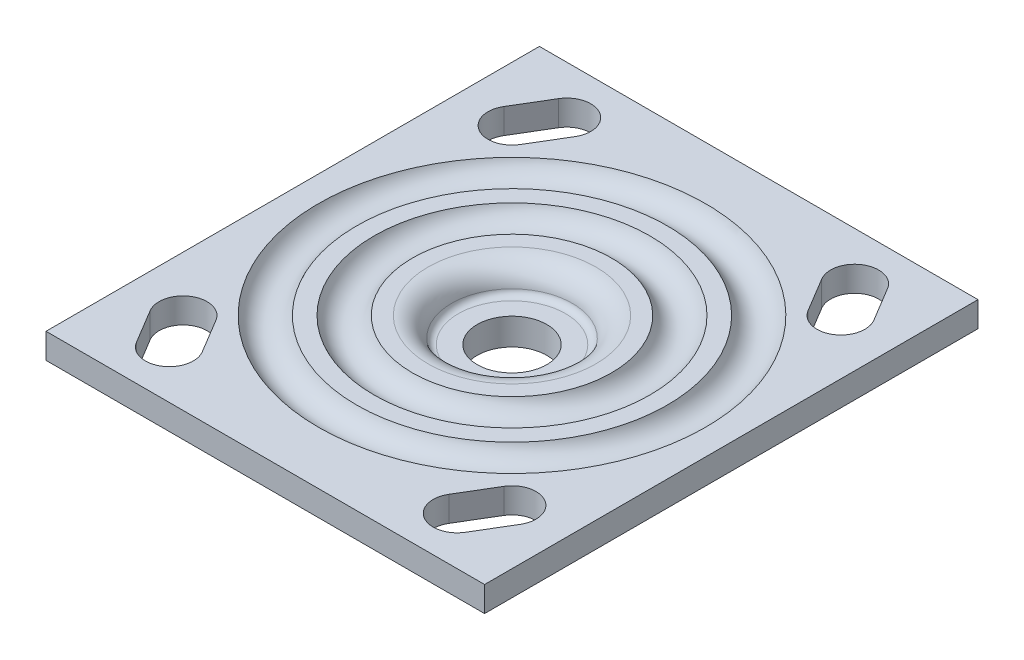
ISO-10303-21;
HEADER;
FILE_DESCRIPTION(('STEP AP214'),'2;1');
FILE_NAME('part.step','',(''),(''),'','','');
FILE_SCHEMA(('AUTOMOTIVE_DESIGN { 1 0 10303 214 1 1 1 1 }'));
ENDSEC;
DATA;
#1=APPLICATION_CONTEXT('core data for automotive mechanical design processes');
#2=APPLICATION_PROTOCOL_DEFINITION('international standard','automotive_design',2000,#1);
#3=PRODUCT_CONTEXT('',#1,'mechanical');
#4=PRODUCT('Part','Part','',(#3));
#5=PRODUCT_RELATED_PRODUCT_CATEGORY('part','',(#4));
#6=PRODUCT_DEFINITION_FORMATION('','',#4);
#7=PRODUCT_DEFINITION_CONTEXT('part definition',#1,'design');
#8=PRODUCT_DEFINITION('design','',#6,#7);
#9=PRODUCT_DEFINITION_SHAPE('','',#8);
#10=(LENGTH_UNIT() NAMED_UNIT(*) SI_UNIT(.MILLI.,.METRE.));
#11=(NAMED_UNIT(*) PLANE_ANGLE_UNIT() SI_UNIT($,.RADIAN.));
#12=(NAMED_UNIT(*) SI_UNIT($,.STERADIAN.) SOLID_ANGLE_UNIT());
#13=UNCERTAINTY_MEASURE_WITH_UNIT(LENGTH_MEASURE(1.E-05),#10,'distance_accuracy_value','');
#14=(GEOMETRIC_REPRESENTATION_CONTEXT(3) GLOBAL_UNCERTAINTY_ASSIGNED_CONTEXT((#13)) GLOBAL_UNIT_ASSIGNED_CONTEXT((#10,
#11,#12)) REPRESENTATION_CONTEXT('',''));
#15=CARTESIAN_POINT('',(0.,0.,0.));
#16=DIRECTION('',(0.,0.,1.));
#17=DIRECTION('',(1.,0.,0.));
#18=AXIS2_PLACEMENT_3D('',#15,#16,#17);
#19=CARTESIAN_POINT('',(44.8570225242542,0.,0.));
#20=DIRECTION('',(0.,-1.,0.));
#21=DIRECTION('',(0.,0.,-1.));
#22=AXIS2_PLACEMENT_3D('',#19,#20,#21);
#23=PLANE('',#22);
#24=DIRECTION('',(-0.514495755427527,0.,0.857492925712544));
#25=VECTOR('',#24,1.);
#26=CARTESIAN_POINT('',(33.3355549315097,0.,35.2413329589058));
#27=LINE('',#26,#25);
#28=CARTESIAN_POINT('',(33.3355549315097,0.,35.2413329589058));
#29=VERTEX_POINT('',#28);
#30=CARTESIAN_POINT('',(28.5730549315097,0.,43.1788329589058));
#31=VERTEX_POINT('',#30);
#32=EDGE_CURVE('E525',#29,#31,#27,.T.);
#33=ORIENTED_EDGE('',*,*,#32,.F.);
#34=CARTESIAN_POINT('',(38.1,0.,38.1));
#35=DIRECTION('',(0.,1.,0.));
#36=DIRECTION('',(0.,0.,1.));
#37=AXIS2_PLACEMENT_3D('',#34,#35,#36);
#38=CIRCLE('',#37,5.55625);
#39=CARTESIAN_POINT('',(42.8644450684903,0.,40.9586670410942));
#40=VERTEX_POINT('',#39);
#41=EDGE_CURVE('E381',#40,#29,#38,.T.);
#42=ORIENTED_EDGE('',*,*,#41,.F.);
#43=DIRECTION('',(0.514495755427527,0.,-0.857492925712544));
#44=VECTOR('',#43,1.);
#45=CARTESIAN_POINT('',(42.8644450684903,0.,40.9586670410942));
#46=LINE('',#45,#44);
#47=CARTESIAN_POINT('',(38.1019450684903,0.,48.8961670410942));
#48=VERTEX_POINT('',#47);
#49=EDGE_CURVE('E511',#48,#40,#46,.T.);
#50=ORIENTED_EDGE('',*,*,#49,.F.);
#51=CARTESIAN_POINT('',(33.3375,0.,46.0375));
#52=DIRECTION('',(0.,1.,0.));
#53=DIRECTION('',(0.,0.,1.));
#54=AXIS2_PLACEMENT_3D('',#51,#52,#53);
#55=CIRCLE('',#54,5.55625);
#56=EDGE_CURVE('E531',#31,#48,#55,.T.);
#57=ORIENTED_EDGE('',*,*,#56,.F.);
#58=EDGE_LOOP('',(#33,#42,#50,#57));
#59=FACE_BOUND('',#58,.T.);
#60=DIRECTION('',(0.514495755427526,0.,0.857492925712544));
#61=VECTOR('',#60,1.);
#62=CARTESIAN_POINT('',(33.3355549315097,0.,-35.2413329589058));
#63=LINE('',#62,#61);
#64=CARTESIAN_POINT('',(28.5730549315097,0.,-43.1788329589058));
#65=VERTEX_POINT('',#64);
#66=CARTESIAN_POINT('',(33.3355549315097,0.,-35.2413329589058));
#67=VERTEX_POINT('',#66);
#68=EDGE_CURVE('E549',#65,#67,#63,.T.);
#69=ORIENTED_EDGE('',*,*,#68,.F.);
#70=CARTESIAN_POINT('',(33.3375,0.,-46.0375));
#71=DIRECTION('',(0.,1.,0.));
#72=DIRECTION('',(0.,0.,1.));
#73=AXIS2_PLACEMENT_3D('',#70,#71,#72);
#74=CIRCLE('',#73,5.55625);
#75=CARTESIAN_POINT('',(38.1019450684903,0.,-48.8961670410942));
#76=VERTEX_POINT('',#75);
#77=EDGE_CURVE('E547',#76,#65,#74,.T.);
#78=ORIENTED_EDGE('',*,*,#77,.F.);
#79=DIRECTION('',(-0.514495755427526,0.,-0.857492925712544));
#80=VECTOR('',#79,1.);
#81=CARTESIAN_POINT('',(38.1019450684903,0.,-48.8961670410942));
#82=LINE('',#81,#80);
#83=CARTESIAN_POINT('',(42.8644450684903,0.,-40.9586670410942));
#84=VERTEX_POINT('',#83);
#85=EDGE_CURVE('E555',#84,#76,#82,.T.);
#86=ORIENTED_EDGE('',*,*,#85,.F.);
#87=CARTESIAN_POINT('',(38.1,0.,-38.1));
#88=DIRECTION('',(0.,1.,0.));
#89=DIRECTION('',(0.,0.,1.));
#90=AXIS2_PLACEMENT_3D('',#87,#88,#89);
#91=CIRCLE('',#90,5.55625);
#92=EDGE_CURVE('E552',#67,#84,#91,.T.);
#93=ORIENTED_EDGE('',*,*,#92,.F.);
#94=EDGE_LOOP('',(#69,#78,#86,#93));
#95=FACE_BOUND('',#94,.T.);
#96=DIRECTION('',(0.514495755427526,0.,-0.857492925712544));
#97=VECTOR('',#96,1.);
#98=CARTESIAN_POINT('',(-33.3355549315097,0.,-35.2413329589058));
#99=LINE('',#98,#97);
#100=CARTESIAN_POINT('',(-33.3355549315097,0.,-35.2413329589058));
#101=VERTEX_POINT('',#100);
#102=CARTESIAN_POINT('',(-28.5730549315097,0.,-43.1788329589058));
#103=VERTEX_POINT('',#102);
#104=EDGE_CURVE('E580',#101,#103,#99,.T.);
#105=ORIENTED_EDGE('',*,*,#104,.F.);
#106=CARTESIAN_POINT('',(-38.1,0.,-38.1));
#107=DIRECTION('',(0.,1.,0.));
#108=DIRECTION('',(0.,0.,1.));
#109=AXIS2_PLACEMENT_3D('',#106,#107,#108);
#110=CIRCLE('',#109,5.55625);
#111=CARTESIAN_POINT('',(-42.8644450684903,0.,-40.9586670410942));
#112=VERTEX_POINT('',#111);
#113=EDGE_CURVE('E578',#112,#101,#110,.T.);
#114=ORIENTED_EDGE('',*,*,#113,.F.);
#115=DIRECTION('',(-0.514495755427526,0.,0.857492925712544));
#116=VECTOR('',#115,1.);
#117=CARTESIAN_POINT('',(-38.1019450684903,0.,-48.8961670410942));
#118=LINE('',#117,#116);
#119=CARTESIAN_POINT('',(-38.1019450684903,0.,-48.8961670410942));
#120=VERTEX_POINT('',#119);
#121=EDGE_CURVE('E586',#120,#112,#118,.T.);
#122=ORIENTED_EDGE('',*,*,#121,.F.);
#123=CARTESIAN_POINT('',(-33.3375,0.,-46.0375));
#124=DIRECTION('',(0.,1.,0.));
#125=DIRECTION('',(0.,0.,1.));
#126=AXIS2_PLACEMENT_3D('',#123,#124,#125);
#127=CIRCLE('',#126,5.55625);
#128=EDGE_CURVE('E583',#103,#120,#127,.T.);
#129=ORIENTED_EDGE('',*,*,#128,.F.);
#130=EDGE_LOOP('',(#105,#114,#122,#129));
#131=FACE_BOUND('',#130,.T.);
#132=DIRECTION('',(0.514495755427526,0.,0.857492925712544));
#133=VECTOR('',#132,1.);
#134=CARTESIAN_POINT('',(-42.8644450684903,0.,40.9586670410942));
#135=LINE('',#134,#133);
#136=CARTESIAN_POINT('',(-42.8644450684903,0.,40.9586670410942));
#137=VERTEX_POINT('',#136);
#138=CARTESIAN_POINT('',(-38.1019450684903,0.,48.8961670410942));
#139=VERTEX_POINT('',#138);
#140=EDGE_CURVE('E611',#137,#139,#135,.T.);
#141=ORIENTED_EDGE('',*,*,#140,.F.);
#142=CARTESIAN_POINT('',(-38.1,0.,38.1));
#143=DIRECTION('',(0.,1.,0.));
#144=DIRECTION('',(0.,0.,1.));
#145=AXIS2_PLACEMENT_3D('',#142,#143,#144);
#146=CIRCLE('',#145,5.55625);
#147=CARTESIAN_POINT('',(-33.3355549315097,0.,35.2413329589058));
#148=VERTEX_POINT('',#147);
#149=EDGE_CURVE('E609',#148,#137,#146,.T.);
#150=ORIENTED_EDGE('',*,*,#149,.F.);
#151=DIRECTION('',(-0.514495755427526,0.,-0.857492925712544));
#152=VECTOR('',#151,1.);
#153=CARTESIAN_POINT('',(-28.5730549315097,0.,43.1788329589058));
#154=LINE('',#153,#152);
#155=CARTESIAN_POINT('',(-28.5730549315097,0.,43.1788329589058));
#156=VERTEX_POINT('',#155);
#157=EDGE_CURVE('E617',#156,#148,#154,.T.);
#158=ORIENTED_EDGE('',*,*,#157,.F.);
#159=CARTESIAN_POINT('',(-33.3375,0.,46.0375));
#160=DIRECTION('',(0.,1.,0.));
#161=DIRECTION('',(0.,0.,1.));
#162=AXIS2_PLACEMENT_3D('',#159,#160,#161);
#163=CIRCLE('',#162,5.55625);
#164=EDGE_CURVE('E614',#139,#156,#163,.T.);
#165=ORIENTED_EDGE('',*,*,#164,.F.);
#166=EDGE_LOOP('',(#141,#150,#158,#165));
#167=FACE_BOUND('',#166,.T.);
#168=CARTESIAN_POINT('',(0.,0.,0.));
#169=DIRECTION('',(0.,1.,0.));
#170=DIRECTION('',(0.,0.,1.));
#171=AXIS2_PLACEMENT_3D('',#168,#169,#170);
#172=CIRCLE('',#171,44.8570225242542);
#173=CARTESIAN_POINT('',(0.,0.,44.8570225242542));
#174=VERTEX_POINT('',#173);
#175=EDGE_CURVE('E11',#174,#174,#172,.T.);
#176=ORIENTED_EDGE('',*,*,#175,.F.);
#177=EDGE_LOOP('',(#176));
#178=FACE_BOUND('',#177,.T.);
#179=DIRECTION('',(0.,0.,1.));
#180=VECTOR('',#179,1.);
#181=CARTESIAN_POINT('',(-50.8,0.,-57.15));
#182=LINE('',#181,#180);
#183=CARTESIAN_POINT('',(-50.8,0.,-57.15));
#184=VERTEX_POINT('',#183);
#185=CARTESIAN_POINT('',(-50.8,0.,57.15));
#186=VERTEX_POINT('',#185);
#187=EDGE_CURVE('E632',#184,#186,#182,.T.);
#188=ORIENTED_EDGE('',*,*,#187,.T.);
#189=DIRECTION('',(1.,0.,0.));
#190=VECTOR('',#189,1.);
#191=CARTESIAN_POINT('',(-50.8,0.,57.15));
#192=LINE('',#191,#190);
#193=CARTESIAN_POINT('',(50.8,0.,57.15));
#194=VERTEX_POINT('',#193);
#195=EDGE_CURVE('E645',#186,#194,#192,.T.);
#196=ORIENTED_EDGE('',*,*,#195,.T.);
#197=DIRECTION('',(0.,0.,-1.));
#198=VECTOR('',#197,1.);
#199=CARTESIAN_POINT('',(50.8,0.,-57.15));
#200=LINE('',#199,#198);
#201=CARTESIAN_POINT('',(50.8,0.,-57.15));
#202=VERTEX_POINT('',#201);
#203=EDGE_CURVE('E648',#194,#202,#200,.T.);
#204=ORIENTED_EDGE('',*,*,#203,.T.);
#205=DIRECTION('',(-1.,0.,0.));
#206=VECTOR('',#205,1.);
#207=CARTESIAN_POINT('',(-50.8,0.,-57.15));
#208=LINE('',#207,#206);
#209=EDGE_CURVE('E651',#202,#184,#208,.T.);
#210=ORIENTED_EDGE('',*,*,#209,.T.);
#211=EDGE_LOOP('',(#188,#196,#204,#210));
#212=FACE_BOUND('',#211,.T.);
#213=ADVANCED_FACE('F367',(#59,#95,#131,#167,#178,#212),#23,.F.);
#214=CARTESIAN_POINT('',(0.,1.7526,0.));
#215=DIRECTION('',(0.,1.,0.));
#216=DIRECTION('',(0.,0.,1.));
#217=AXIS2_PLACEMENT_3D('',#214,#215,#216);
#218=TOROIDAL_SURFACE('',#217,40.41507157,4.7752);
#219=CARTESIAN_POINT('',(0.,0.,0.));
#220=DIRECTION('',(0.,1.,0.));
#221=DIRECTION('',(0.,0.,1.));
#222=AXIS2_PLACEMENT_3D('',#219,#220,#221);
#223=CIRCLE('',#222,35.9731206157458);
#224=CARTESIAN_POINT('',(0.,0.,35.9731206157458));
#225=VERTEX_POINT('',#224);
#226=EDGE_CURVE('E374',#225,#225,#223,.T.);
#227=ORIENTED_EDGE('',*,*,#226,.F.);
#228=EDGE_LOOP('',(#227));
#229=FACE_BOUND('',#228,.T.);
#230=ORIENTED_EDGE('',*,*,#175,.T.);
#231=EDGE_LOOP('',(#230));
#232=FACE_BOUND('',#231,.T.);
#233=ADVANCED_FACE('F709',(#229,#232),#218,.F.);
#234=CARTESIAN_POINT('',(31.9406259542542,0.,0.));
#235=DIRECTION('',(0.,-1.,0.));
#236=DIRECTION('',(0.,0.,-1.));
#237=AXIS2_PLACEMENT_3D('',#234,#235,#236);
#238=PLANE('',#237);
#239=CARTESIAN_POINT('',(0.,0.,0.));
#240=DIRECTION('',(0.,1.,0.));
#241=DIRECTION('',(0.,0.,1.));
#242=AXIS2_PLACEMENT_3D('',#239,#240,#241);
#243=CIRCLE('',#242,31.9406259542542);
#244=CARTESIAN_POINT('',(0.,0.,31.9406259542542));
#245=VERTEX_POINT('',#244);
#246=EDGE_CURVE('E702',#245,#245,#243,.T.);
#247=ORIENTED_EDGE('',*,*,#246,.F.);
#248=EDGE_LOOP('',(#247));
#249=FACE_BOUND('',#248,.T.);
#250=ORIENTED_EDGE('',*,*,#226,.T.);
#251=EDGE_LOOP('',(#250));
#252=FACE_BOUND('',#251,.T.);
#253=ADVANCED_FACE('F707',(#249,#252),#238,.F.);
#254=CARTESIAN_POINT('',(0.,1.7526,0.));
#255=DIRECTION('',(0.,1.,0.));
#256=DIRECTION('',(0.,0.,1.));
#257=AXIS2_PLACEMENT_3D('',#254,#255,#256);
#258=TOROIDAL_SURFACE('',#257,27.498675,4.7752);
#259=CARTESIAN_POINT('',(0.,0.,0.));
#260=DIRECTION('',(0.,1.,0.));
#261=DIRECTION('',(0.,0.,1.));
#262=AXIS2_PLACEMENT_3D('',#259,#260,#261);
#263=CIRCLE('',#262,23.0567240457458);
#264=CARTESIAN_POINT('',(0.,0.,23.0567240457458));
#265=VERTEX_POINT('',#264);
#266=EDGE_CURVE('E699',#265,#265,#263,.T.);
#267=ORIENTED_EDGE('',*,*,#266,.F.);
#268=EDGE_LOOP('',(#267));
#269=FACE_BOUND('',#268,.T.);
#270=ORIENTED_EDGE('',*,*,#246,.T.);
#271=EDGE_LOOP('',(#270));
#272=FACE_BOUND('',#271,.T.);
#273=ADVANCED_FACE('F798',(#269,#272),#258,.F.);
#274=CARTESIAN_POINT('',(19.441696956,0.,0.));
#275=DIRECTION('',(0.,-1.,0.));
#276=DIRECTION('',(0.,0.,-1.));
#277=AXIS2_PLACEMENT_3D('',#274,#275,#276);
#278=PLANE('',#277);
#279=CARTESIAN_POINT('',(0.,0.,0.));
#280=DIRECTION('',(0.,1.,0.));
#281=DIRECTION('',(0.,0.,1.));
#282=AXIS2_PLACEMENT_3D('',#279,#280,#281);
#283=CIRCLE('',#282,19.441696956);
#284=CARTESIAN_POINT('',(0.,0.,19.441696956));
#285=VERTEX_POINT('',#284);
#286=EDGE_CURVE('E696',#285,#285,#283,.T.);
#287=ORIENTED_EDGE('',*,*,#286,.F.);
#288=EDGE_LOOP('',(#287));
#289=FACE_BOUND('',#288,.T.);
#290=ORIENTED_EDGE('',*,*,#266,.T.);
#291=EDGE_LOOP('',(#290));
#292=FACE_BOUND('',#291,.T.);
#293=ADVANCED_FACE('F794',(#289,#292),#278,.F.);
#294=CARTESIAN_POINT('',(0.,-5.55625,0.));
#295=DIRECTION('',(0.,1.,0.));
#296=DIRECTION('',(0.,0.,1.));
#297=AXIS2_PLACEMENT_3D('',#294,#295,#296);
#298=TOROIDAL_SURFACE('',#297,19.441696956,5.55625);
#299=CARTESIAN_POINT('',(0.,-4.54377777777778,0.));
#300=DIRECTION('',(0.,1.,0.));
#301=DIRECTION('',(0.,0.,1.));
#302=AXIS2_PLACEMENT_3D('',#299,#300,#301);
#303=CIRCLE('',#302,13.9784731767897);
#304=CARTESIAN_POINT('',(0.,-4.54377777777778,13.9784731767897));
#305=VERTEX_POINT('',#304);
#306=EDGE_CURVE('E693',#305,#305,#303,.T.);
#307=ORIENTED_EDGE('',*,*,#306,.F.);
#308=EDGE_LOOP('',(#307));
#309=FACE_BOUND('',#308,.T.);
#310=ORIENTED_EDGE('',*,*,#286,.T.);
#311=EDGE_LOOP('',(#310));
#312=FACE_BOUND('',#311,.T.);
#313=ADVANCED_FACE('F790',(#309,#312),#298,.T.);
#314=CARTESIAN_POINT('',(0.,-4.2545,0.));
#315=DIRECTION('',(0.,1.,0.));
#316=DIRECTION('',(0.,0.,1.));
#317=AXIS2_PLACEMENT_3D('',#314,#315,#316);
#318=TOROIDAL_SURFACE('',#317,12.4175520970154,1.5875);
#319=CARTESIAN_POINT('',(0.,-5.842,0.));
#320=DIRECTION('',(0.,1.,0.));
#321=DIRECTION('',(0.,0.,1.));
#322=AXIS2_PLACEMENT_3D('',#319,#320,#321);
#323=CIRCLE('',#322,12.4175520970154);
#324=CARTESIAN_POINT('',(0.,-5.842,12.4175520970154));
#325=VERTEX_POINT('',#324);
#326=EDGE_CURVE('E690',#325,#325,#323,.T.);
#327=ORIENTED_EDGE('',*,*,#326,.F.);
#328=EDGE_LOOP('',(#327));
#329=FACE_BOUND('',#328,.T.);
#330=ORIENTED_EDGE('',*,*,#306,.T.);
#331=EDGE_LOOP('',(#330));
#332=FACE_BOUND('',#331,.T.);
#333=ADVANCED_FACE('F786',(#329,#332),#318,.F.);
#334=CARTESIAN_POINT('',(8.0645,-5.842,0.));
#335=DIRECTION('',(0.,-1.,0.));
#336=DIRECTION('',(0.,0.,-1.));
#337=AXIS2_PLACEMENT_3D('',#334,#335,#336);
#338=PLANE('',#337);
#339=CARTESIAN_POINT('',(0.,-5.842,0.));
#340=DIRECTION('',(0.,1.,0.));
#341=DIRECTION('',(0.,0.,1.));
#342=AXIS2_PLACEMENT_3D('',#339,#340,#341);
#343=CIRCLE('',#342,8.0645);
#344=CARTESIAN_POINT('',(0.,-5.842,8.0645));
#345=VERTEX_POINT('',#344);
#346=EDGE_CURVE('E687',#345,#345,#343,.T.);
#347=ORIENTED_EDGE('',*,*,#346,.F.);
#348=EDGE_LOOP('',(#347));
#349=FACE_BOUND('',#348,.T.);
#350=ORIENTED_EDGE('',*,*,#326,.T.);
#351=EDGE_LOOP('',(#350));
#352=FACE_BOUND('',#351,.T.);
#353=ADVANCED_FACE('F782',(#349,#352),#338,.F.);
#354=CARTESIAN_POINT('',(0.,0.,0.));
#355=DIRECTION('',(0.,1.,0.));
#356=DIRECTION('',(0.,0.,1.));
#357=AXIS2_PLACEMENT_3D('',#354,#355,#356);
#358=CYLINDRICAL_SURFACE('',#357,8.0645);
#359=CARTESIAN_POINT('',(0.,-12.0396,0.));
#360=DIRECTION('',(0.,1.,0.));
#361=DIRECTION('',(0.,0.,1.));
#362=AXIS2_PLACEMENT_3D('',#359,#360,#361);
#363=CIRCLE('',#362,8.0645);
#364=CARTESIAN_POINT('',(0.,-12.0396,8.0645));
#365=VERTEX_POINT('',#364);
#366=EDGE_CURVE('E684',#365,#365,#363,.T.);
#367=ORIENTED_EDGE('',*,*,#366,.F.);
#368=EDGE_LOOP('',(#367));
#369=FACE_BOUND('',#368,.T.);
#370=ORIENTED_EDGE('',*,*,#346,.T.);
#371=EDGE_LOOP('',(#370));
#372=FACE_BOUND('',#371,.T.);
#373=ADVANCED_FACE('F778',(#369,#372),#358,.F.);
#374=CARTESIAN_POINT('',(14.0562775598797,-12.0396,0.));
#375=DIRECTION('',(0.,1.,0.));
#376=DIRECTION('',(0.,0.,1.));
#377=AXIS2_PLACEMENT_3D('',#374,#375,#376);
#378=PLANE('',#377);
#379=CARTESIAN_POINT('',(0.,-12.0396,0.));
#380=DIRECTION('',(0.,1.,0.));
#381=DIRECTION('',(0.,0.,1.));
#382=AXIS2_PLACEMENT_3D('',#379,#380,#381);
#383=CIRCLE('',#382,14.0562775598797);
#384=CARTESIAN_POINT('',(0.,-12.0396,14.0562775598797));
#385=VERTEX_POINT('',#384);
#386=EDGE_CURVE('E681',#385,#385,#383,.T.);
#387=ORIENTED_EDGE('',*,*,#386,.F.);
#388=EDGE_LOOP('',(#387));
#389=FACE_BOUND('',#388,.T.);
#390=ORIENTED_EDGE('',*,*,#366,.T.);
#391=EDGE_LOOP('',(#390));
#392=FACE_BOUND('',#391,.T.);
#393=ADVANCED_FACE('F774',(#389,#392),#378,.F.);
#394=CARTESIAN_POINT('',(0.,-6.5024,0.));
#395=DIRECTION('',(0.,1.,0.));
#396=DIRECTION('',(0.,0.,1.));
#397=AXIS2_PLACEMENT_3D('',#394,#395,#396);
#398=TOROIDAL_SURFACE('',#397,14.0562775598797,5.5372);
#399=CARTESIAN_POINT('',(0.,-8.4295083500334,0.));
#400=DIRECTION('',(0.,1.,0.));
#401=DIRECTION('',(0.,0.,1.));
#402=AXIS2_PLACEMENT_3D('',#399,#400,#401);
#403=CIRCLE('',#402,19.2473118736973);
#404=CARTESIAN_POINT('',(0.,-8.4295083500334,19.2473118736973));
#405=VERTEX_POINT('',#404);
#406=EDGE_CURVE('E678',#405,#405,#403,.T.);
#407=ORIENTED_EDGE('',*,*,#406,.F.);
#408=EDGE_LOOP('',(#407));
#409=FACE_BOUND('',#408,.T.);
#410=ORIENTED_EDGE('',*,*,#386,.T.);
#411=EDGE_LOOP('',(#410));
#412=FACE_BOUND('',#411,.T.);
#413=ADVANCED_FACE('F770',(#409,#412),#398,.T.);
#414=CARTESIAN_POINT('',(0.,-9.81075,0.));
#415=DIRECTION('',(0.,1.,0.));
#416=DIRECTION('',(0.,0.,1.));
#417=AXIS2_PLACEMENT_3D('',#414,#415,#416);
#418=TOROIDAL_SURFACE('',#417,22.96795,3.96875);
#419=CARTESIAN_POINT('',(0.,-7.239,0.));
#420=DIRECTION('',(0.,1.,0.));
#421=DIRECTION('',(0.,0.,1.));
#422=AXIS2_PLACEMENT_3D('',#419,#420,#421);
#423=CIRCLE('',#422,25.9907100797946);
#424=CARTESIAN_POINT('',(0.,-7.239,25.9907100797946));
#425=VERTEX_POINT('',#424);
#426=EDGE_CURVE('E675',#425,#425,#423,.T.);
#427=ORIENTED_EDGE('',*,*,#426,.F.);
#428=EDGE_LOOP('',(#427));
#429=FACE_BOUND('',#428,.T.);
#430=ORIENTED_EDGE('',*,*,#406,.T.);
#431=EDGE_LOOP('',(#430));
#432=FACE_BOUND('',#431,.T.);
#433=ADVANCED_FACE('F766',(#429,#432),#418,.F.);
#434=CARTESIAN_POINT('',(30.0768481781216,-7.239,0.));
#435=DIRECTION('',(0.,1.,0.));
#436=DIRECTION('',(0.,0.,1.));
#437=AXIS2_PLACEMENT_3D('',#434,#435,#436);
#438=PLANE('',#437);
#439=CARTESIAN_POINT('',(0.,-7.239,0.));
#440=DIRECTION('',(0.,1.,0.));
#441=DIRECTION('',(0.,0.,1.));
#442=AXIS2_PLACEMENT_3D('',#439,#440,#441);
#443=CIRCLE('',#442,30.0768481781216);
#444=CARTESIAN_POINT('',(0.,-7.239,30.0768481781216));
#445=VERTEX_POINT('',#444);
#446=EDGE_CURVE('E672',#445,#445,#443,.T.);
#447=ORIENTED_EDGE('',*,*,#446,.F.);
#448=EDGE_LOOP('',(#447));
#449=FACE_BOUND('',#448,.T.);
#450=ORIENTED_EDGE('',*,*,#426,.T.);
#451=EDGE_LOOP('',(#450));
#452=FACE_BOUND('',#451,.T.);
#453=ADVANCED_FACE('F762',(#449,#452),#438,.F.);
#454=CARTESIAN_POINT('',(0.,-10.6172,0.));
#455=DIRECTION('',(0.,1.,0.));
#456=DIRECTION('',(0.,0.,1.));
#457=AXIS2_PLACEMENT_3D('',#454,#455,#456);
#458=TOROIDAL_SURFACE('',#457,33.4518,4.7752);
#459=CARTESIAN_POINT('',(0.,-7.239,0.));
#460=DIRECTION('',(0.,1.,0.));
#461=DIRECTION('',(0.,0.,1.));
#462=AXIS2_PLACEMENT_3D('',#459,#460,#461);
#463=CIRCLE('',#462,36.8267518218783);
#464=CARTESIAN_POINT('',(0.,-7.239,36.8267518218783));
#465=VERTEX_POINT('',#464);
#466=EDGE_CURVE('E669',#465,#465,#463,.T.);
#467=ORIENTED_EDGE('',*,*,#466,.F.);
#468=EDGE_LOOP('',(#467));
#469=FACE_BOUND('',#468,.T.);
#470=ORIENTED_EDGE('',*,*,#446,.T.);
#471=EDGE_LOOP('',(#470));
#472=FACE_BOUND('',#471,.T.);
#473=ADVANCED_FACE('F758',(#469,#472),#458,.F.);
#474=CARTESIAN_POINT('',(42.6670247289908,-7.239,0.));
#475=DIRECTION('',(0.,1.,0.));
#476=DIRECTION('',(0.,0.,1.));
#477=AXIS2_PLACEMENT_3D('',#474,#475,#476);
#478=PLANE('',#477);
#479=CARTESIAN_POINT('',(0.,-7.239,0.));
#480=DIRECTION('',(0.,1.,0.));
#481=DIRECTION('',(0.,0.,1.));
#482=AXIS2_PLACEMENT_3D('',#479,#480,#481);
#483=CIRCLE('',#482,42.6670247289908);
#484=CARTESIAN_POINT('',(0.,-7.239,42.6670247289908));
#485=VERTEX_POINT('',#484);
#486=EDGE_CURVE('E666',#485,#485,#483,.T.);
#487=ORIENTED_EDGE('',*,*,#486,.F.);
#488=EDGE_LOOP('',(#487));
#489=FACE_BOUND('',#488,.T.);
#490=ORIENTED_EDGE('',*,*,#466,.T.);
#491=EDGE_LOOP('',(#490));
#492=FACE_BOUND('',#491,.T.);
#493=ADVANCED_FACE('F754',(#489,#492),#478,.F.);
#494=CARTESIAN_POINT('',(0.,-6.127115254,0.));
#495=DIRECTION('',(0.,1.,0.));
#496=DIRECTION('',(0.,0.,1.));
#497=AXIS2_PLACEMENT_3D('',#494,#495,#496);
#498=TOROIDAL_SURFACE('',#497,42.6670247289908,1.111884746);
#499=CARTESIAN_POINT('',(0.,-6.5405,0.));
#500=DIRECTION('',(0.,1.,0.));
#501=DIRECTION('',(0.,0.,1.));
#502=AXIS2_PLACEMENT_3D('',#499,#500,#501);
#503=CIRCLE('',#502,43.699207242);
#504=CARTESIAN_POINT('',(0.,-6.5405,43.699207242));
#505=VERTEX_POINT('',#504);
#506=EDGE_CURVE('E663',#505,#505,#503,.T.);
#507=ORIENTED_EDGE('',*,*,#506,.F.);
#508=EDGE_LOOP('',(#507));
#509=FACE_BOUND('',#508,.T.);
#510=ORIENTED_EDGE('',*,*,#486,.T.);
#511=EDGE_LOOP('',(#510));
#512=FACE_BOUND('',#511,.T.);
#513=ADVANCED_FACE('F747',(#509,#512),#498,.T.);
#514=CARTESIAN_POINT('',(0.,-6.953884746,0.));
#515=DIRECTION('',(0.,1.,0.));
#516=DIRECTION('',(0.,0.,1.));
#517=AXIS2_PLACEMENT_3D('',#514,#515,#516);
#518=TOROIDAL_SURFACE('',#517,44.7313897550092,1.111884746);
#519=CARTESIAN_POINT('',(0.,-5.842,0.));
#520=DIRECTION('',(0.,1.,0.));
#521=DIRECTION('',(0.,0.,1.));
#522=AXIS2_PLACEMENT_3D('',#519,#520,#521);
#523=CIRCLE('',#522,44.7313897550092);
#524=CARTESIAN_POINT('',(0.,-5.842,44.7313897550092));
#525=VERTEX_POINT('',#524);
#526=EDGE_CURVE('E635',#525,#525,#523,.T.);
#527=ORIENTED_EDGE('',*,*,#526,.F.);
#528=EDGE_LOOP('',(#527));
#529=FACE_BOUND('',#528,.T.);
#530=ORIENTED_EDGE('',*,*,#506,.T.);
#531=EDGE_LOOP('',(#530));
#532=FACE_BOUND('',#531,.T.);
#533=ADVANCED_FACE('F739',(#529,#532),#518,.F.);
#534=CARTESIAN_POINT('',(47.625,-5.842,0.));
#535=DIRECTION('',(0.,1.,0.));
#536=DIRECTION('',(0.,0.,1.));
#537=AXIS2_PLACEMENT_3D('',#534,#535,#536);
#538=PLANE('',#537);
#539=DIRECTION('',(-0.514495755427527,0.,0.857492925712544));
#540=VECTOR('',#539,1.);
#541=CARTESIAN_POINT('',(42.8644450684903,-5.842,40.9586670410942));
#542=LINE('',#541,#540);
#543=CARTESIAN_POINT('',(42.8644450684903,-5.842,40.9586670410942));
#544=VERTEX_POINT('',#543);
#545=CARTESIAN_POINT('',(38.1019450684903,-5.842,48.8961670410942));
#546=VERTEX_POINT('',#545);
#547=EDGE_CURVE('E523',#544,#546,#542,.T.);
#548=ORIENTED_EDGE('',*,*,#547,.F.);
#549=CARTESIAN_POINT('',(38.1,-5.842,38.1));
#550=DIRECTION('',(0.,1.,0.));
#551=DIRECTION('',(0.,0.,1.));
#552=AXIS2_PLACEMENT_3D('',#549,#550,#551);
#553=CIRCLE('',#552,5.55625);
#554=CARTESIAN_POINT('',(33.3355549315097,-5.842,35.2413329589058));
#555=VERTEX_POINT('',#554);
#556=EDGE_CURVE('E505',#555,#544,#553,.F.);
#557=ORIENTED_EDGE('',*,*,#556,.F.);
#558=DIRECTION('',(0.514495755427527,0.,-0.857492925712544));
#559=VECTOR('',#558,1.);
#560=CARTESIAN_POINT('',(33.3355549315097,-5.842,35.2413329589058));
#561=LINE('',#560,#559);
#562=CARTESIAN_POINT('',(28.5730549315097,-5.842,43.1788329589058));
#563=VERTEX_POINT('',#562);
#564=EDGE_CURVE('E514',#563,#555,#561,.T.);
#565=ORIENTED_EDGE('',*,*,#564,.F.);
#566=CARTESIAN_POINT('',(33.3375,-5.842,46.0375));
#567=DIRECTION('',(0.,1.,0.));
#568=DIRECTION('',(0.,0.,1.));
#569=AXIS2_PLACEMENT_3D('',#566,#567,#568);
#570=CIRCLE('',#569,5.55625);
#571=EDGE_CURVE('E389',#546,#563,#570,.F.);
#572=ORIENTED_EDGE('',*,*,#571,.F.);
#573=EDGE_LOOP('',(#548,#557,#565,#572));
#574=FACE_BOUND('',#573,.T.);
#575=DIRECTION('',(0.514495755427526,0.,0.857492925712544));
#576=VECTOR('',#575,1.);
#577=CARTESIAN_POINT('',(38.1019450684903,-5.842,-48.8961670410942));
#578=LINE('',#577,#576);
#579=CARTESIAN_POINT('',(38.1019450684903,-5.842,-48.8961670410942));
#580=VERTEX_POINT('',#579);
#581=CARTESIAN_POINT('',(42.8644450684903,-5.842,-40.9586670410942));
#582=VERTEX_POINT('',#581);
#583=EDGE_CURVE('E541',#580,#582,#578,.T.);
#584=ORIENTED_EDGE('',*,*,#583,.F.);
#585=CARTESIAN_POINT('',(33.3375,-5.842,-46.0375));
#586=DIRECTION('',(0.,1.,0.));
#587=DIRECTION('',(0.,0.,1.));
#588=AXIS2_PLACEMENT_3D('',#585,#586,#587);
#589=CIRCLE('',#588,5.55625);
#590=CARTESIAN_POINT('',(28.5730549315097,-5.842,-43.1788329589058));
#591=VERTEX_POINT('',#590);
#592=EDGE_CURVE('E544',#591,#580,#589,.F.);
#593=ORIENTED_EDGE('',*,*,#592,.F.);
#594=DIRECTION('',(-0.514495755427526,0.,-0.857492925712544));
#595=VECTOR('',#594,1.);
#596=CARTESIAN_POINT('',(33.3355549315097,-5.842,-35.2413329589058));
#597=LINE('',#596,#595);
#598=CARTESIAN_POINT('',(33.3355549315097,-5.842,-35.2413329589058));
#599=VERTEX_POINT('',#598);
#600=EDGE_CURVE('E561',#599,#591,#597,.T.);
#601=ORIENTED_EDGE('',*,*,#600,.F.);
#602=CARTESIAN_POINT('',(38.1,-5.842,-38.1));
#603=DIRECTION('',(0.,1.,0.));
#604=DIRECTION('',(0.,0.,1.));
#605=AXIS2_PLACEMENT_3D('',#602,#603,#604);
#606=CIRCLE('',#605,5.55625);
#607=EDGE_CURVE('E517',#582,#599,#606,.F.);
#608=ORIENTED_EDGE('',*,*,#607,.F.);
#609=EDGE_LOOP('',(#584,#593,#601,#608));
#610=FACE_BOUND('',#609,.T.);
#611=DIRECTION('',(0.514495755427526,0.,-0.857492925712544));
#612=VECTOR('',#611,1.);
#613=CARTESIAN_POINT('',(-38.1019450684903,-5.842,-48.8961670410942));
#614=LINE('',#613,#612);
#615=CARTESIAN_POINT('',(-42.8644450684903,-5.842,-40.9586670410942));
#616=VERTEX_POINT('',#615);
#617=CARTESIAN_POINT('',(-38.1019450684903,-5.842,-48.8961670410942));
#618=VERTEX_POINT('',#617);
#619=EDGE_CURVE('E572',#616,#618,#614,.T.);
#620=ORIENTED_EDGE('',*,*,#619,.F.);
#621=CARTESIAN_POINT('',(-38.1,-5.842,-38.1));
#622=DIRECTION('',(0.,1.,0.));
#623=DIRECTION('',(0.,0.,1.));
#624=AXIS2_PLACEMENT_3D('',#621,#622,#623);
#625=CIRCLE('',#624,5.55625);
#626=CARTESIAN_POINT('',(-33.3355549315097,-5.842,-35.2413329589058));
#627=VERTEX_POINT('',#626);
#628=EDGE_CURVE('E575',#627,#616,#625,.F.);
#629=ORIENTED_EDGE('',*,*,#628,.F.);
#630=DIRECTION('',(-0.514495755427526,0.,0.857492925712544));
#631=VECTOR('',#630,1.);
#632=CARTESIAN_POINT('',(-33.3355549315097,-5.842,-35.2413329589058));
#633=LINE('',#632,#631);
#634=CARTESIAN_POINT('',(-28.5730549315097,-5.842,-43.1788329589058));
#635=VERTEX_POINT('',#634);
#636=EDGE_CURVE('E592',#635,#627,#633,.T.);
#637=ORIENTED_EDGE('',*,*,#636,.F.);
#638=CARTESIAN_POINT('',(-33.3375,-5.842,-46.0375));
#639=DIRECTION('',(0.,1.,0.));
#640=DIRECTION('',(0.,0.,1.));
#641=AXIS2_PLACEMENT_3D('',#638,#639,#640);
#642=CIRCLE('',#641,5.55625);
#643=EDGE_CURVE('E570',#618,#635,#642,.F.);
#644=ORIENTED_EDGE('',*,*,#643,.F.);
#645=EDGE_LOOP('',(#620,#629,#637,#644));
#646=FACE_BOUND('',#645,.T.);
#647=DIRECTION('',(0.514495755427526,0.,0.857492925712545));
#648=VECTOR('',#647,1.);
#649=CARTESIAN_POINT('',(-28.5730549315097,-5.842,43.1788329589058));
#650=LINE('',#649,#648);
#651=CARTESIAN_POINT('',(-33.3355549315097,-5.842,35.2413329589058));
#652=VERTEX_POINT('',#651);
#653=CARTESIAN_POINT('',(-28.5730549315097,-5.842,43.1788329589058));
#654=VERTEX_POINT('',#653);
#655=EDGE_CURVE('E603',#652,#654,#650,.T.);
#656=ORIENTED_EDGE('',*,*,#655,.F.);
#657=CARTESIAN_POINT('',(-38.1,-5.842,38.1));
#658=DIRECTION('',(0.,1.,0.));
#659=DIRECTION('',(0.,0.,1.));
#660=AXIS2_PLACEMENT_3D('',#657,#658,#659);
#661=CIRCLE('',#660,5.55625);
#662=CARTESIAN_POINT('',(-42.8644450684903,-5.842,40.9586670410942));
#663=VERTEX_POINT('',#662);
#664=EDGE_CURVE('E606',#663,#652,#661,.F.);
#665=ORIENTED_EDGE('',*,*,#664,.F.);
#666=DIRECTION('',(-0.514495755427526,0.,-0.857492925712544));
#667=VECTOR('',#666,1.);
#668=CARTESIAN_POINT('',(-42.8644450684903,-5.842,40.9586670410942));
#669=LINE('',#668,#667);
#670=CARTESIAN_POINT('',(-38.1019450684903,-5.842,48.8961670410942));
#671=VERTEX_POINT('',#670);
#672=EDGE_CURVE('E623',#671,#663,#669,.T.);
#673=ORIENTED_EDGE('',*,*,#672,.F.);
#674=CARTESIAN_POINT('',(-33.3375,-5.842,46.0375));
#675=DIRECTION('',(0.,1.,0.));
#676=DIRECTION('',(0.,0.,1.));
#677=AXIS2_PLACEMENT_3D('',#674,#675,#676);
#678=CIRCLE('',#677,5.55625);
#679=EDGE_CURVE('E601',#654,#671,#678,.F.);
#680=ORIENTED_EDGE('',*,*,#679,.F.);
#681=EDGE_LOOP('',(#656,#665,#673,#680));
#682=FACE_BOUND('',#681,.T.);
#683=ORIENTED_EDGE('',*,*,#526,.T.);
#684=EDGE_LOOP('',(#683));
#685=FACE_BOUND('',#684,.T.);
#686=DIRECTION('',(0.,0.,-1.));
#687=VECTOR('',#686,1.);
#688=CARTESIAN_POINT('',(-50.8,-5.84200000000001,-57.15));
#689=LINE('',#688,#687);
#690=CARTESIAN_POINT('',(-50.8,-5.84200000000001,57.15));
#691=VERTEX_POINT('',#690);
#692=CARTESIAN_POINT('',(-50.8,-5.84200000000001,-57.15));
#693=VERTEX_POINT('',#692);
#694=EDGE_CURVE('E636',#691,#693,#689,.T.);
#695=ORIENTED_EDGE('',*,*,#694,.T.);
#696=DIRECTION('',(1.,0.,0.));
#697=VECTOR('',#696,1.);
#698=CARTESIAN_POINT('',(-50.8,-5.84200000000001,-57.15));
#699=LINE('',#698,#697);
#700=CARTESIAN_POINT('',(50.8,-5.84200000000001,-57.15));
#701=VERTEX_POINT('',#700);
#702=EDGE_CURVE('E639',#693,#701,#699,.T.);
#703=ORIENTED_EDGE('',*,*,#702,.T.);
#704=DIRECTION('',(0.,0.,1.));
#705=VECTOR('',#704,1.);
#706=CARTESIAN_POINT('',(50.8,-5.84200000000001,-57.15));
#707=LINE('',#706,#705);
#708=CARTESIAN_POINT('',(50.8,-5.84200000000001,57.15));
#709=VERTEX_POINT('',#708);
#710=EDGE_CURVE('E637',#701,#709,#707,.T.);
#711=ORIENTED_EDGE('',*,*,#710,.T.);
#712=DIRECTION('',(-1.,0.,0.));
#713=VECTOR('',#712,1.);
#714=CARTESIAN_POINT('',(-50.8,-5.84200000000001,57.15));
#715=LINE('',#714,#713);
#716=EDGE_CURVE('E633',#709,#691,#715,.T.);
#717=ORIENTED_EDGE('',*,*,#716,.T.);
#718=EDGE_LOOP('',(#695,#703,#711,#717));
#719=FACE_BOUND('',#718,.T.);
#720=ADVANCED_FACE('F520',(#574,#610,#646,#682,#685,#719),#538,.F.);
#721=CARTESIAN_POINT('',(-50.8,-158.770251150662,57.15));
#722=DIRECTION('',(0.,0.,1.));
#723=DIRECTION('',(1.,0.,0.));
#724=AXIS2_PLACEMENT_3D('',#721,#722,#723);
#725=PLANE('',#724);
#726=ORIENTED_EDGE('',*,*,#716,.F.);
#727=DIRECTION('',(0.,1.,0.));
#728=VECTOR('',#727,1.);
#729=CARTESIAN_POINT('',(50.8,-158.770251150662,57.15));
#730=LINE('',#729,#728);
#731=EDGE_CURVE('E658',#709,#194,#730,.T.);
#732=ORIENTED_EDGE('',*,*,#731,.T.);
#733=ORIENTED_EDGE('',*,*,#195,.F.);
#734=DIRECTION('',(0.,1.,0.));
#735=VECTOR('',#734,1.);
#736=CARTESIAN_POINT('',(-50.8,-158.770251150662,57.15));
#737=LINE('',#736,#735);
#738=EDGE_CURVE('E654',#691,#186,#737,.T.);
#739=ORIENTED_EDGE('',*,*,#738,.F.);
#740=EDGE_LOOP('',(#726,#732,#733,#739));
#741=FACE_BOUND('',#740,.T.);
#742=ADVANCED_FACE('F727',(#741),#725,.T.);
#743=CARTESIAN_POINT('',(50.8,-158.770251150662,-57.15));
#744=DIRECTION('',(1.,0.,0.));
#745=DIRECTION('',(0.,0.,-1.));
#746=AXIS2_PLACEMENT_3D('',#743,#744,#745);
#747=PLANE('',#746);
#748=ORIENTED_EDGE('',*,*,#710,.F.);
#749=DIRECTION('',(0.,1.,0.));
#750=VECTOR('',#749,1.);
#751=CARTESIAN_POINT('',(50.8,-158.770251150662,-57.15));
#752=LINE('',#751,#750);
#753=EDGE_CURVE('E656',#701,#202,#752,.T.);
#754=ORIENTED_EDGE('',*,*,#753,.T.);
#755=ORIENTED_EDGE('',*,*,#203,.F.);
#756=ORIENTED_EDGE('',*,*,#731,.F.);
#757=EDGE_LOOP('',(#748,#754,#755,#756));
#758=FACE_BOUND('',#757,.T.);
#759=ADVANCED_FACE('F732',(#758),#747,.T.);
#760=CARTESIAN_POINT('',(-50.8,-158.770251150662,-57.15));
#761=DIRECTION('',(0.,0.,-1.));
#762=DIRECTION('',(-1.,0.,0.));
#763=AXIS2_PLACEMENT_3D('',#760,#761,#762);
#764=PLANE('',#763);
#765=ORIENTED_EDGE('',*,*,#702,.F.);
#766=DIRECTION('',(0.,1.,0.));
#767=VECTOR('',#766,1.);
#768=CARTESIAN_POINT('',(-50.8,-158.770251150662,-57.15));
#769=LINE('',#768,#767);
#770=EDGE_CURVE('E640',#693,#184,#769,.T.);
#771=ORIENTED_EDGE('',*,*,#770,.T.);
#772=ORIENTED_EDGE('',*,*,#209,.F.);
#773=ORIENTED_EDGE('',*,*,#753,.F.);
#774=EDGE_LOOP('',(#765,#771,#772,#773));
#775=FACE_BOUND('',#774,.T.);
#776=ADVANCED_FACE('F736',(#775),#764,.T.);
#777=CARTESIAN_POINT('',(-50.8,-158.770251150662,-57.15));
#778=DIRECTION('',(-1.,0.,0.));
#779=DIRECTION('',(0.,0.,1.));
#780=AXIS2_PLACEMENT_3D('',#777,#778,#779);
#781=PLANE('',#780);
#782=ORIENTED_EDGE('',*,*,#694,.F.);
#783=ORIENTED_EDGE('',*,*,#738,.T.);
#784=ORIENTED_EDGE('',*,*,#187,.F.);
#785=ORIENTED_EDGE('',*,*,#770,.F.);
#786=EDGE_LOOP('',(#782,#783,#784,#785));
#787=FACE_BOUND('',#786,.T.);
#788=ADVANCED_FACE('F723',(#787),#781,.T.);
#789=CARTESIAN_POINT('',(-38.1,-12.0406,38.1));
#790=DIRECTION('',(0.,1.,0.));
#791=DIRECTION('',(0.,0.,1.));
#792=AXIS2_PLACEMENT_3D('',#789,#790,#791);
#793=CYLINDRICAL_SURFACE('',#792,5.55625);
#794=ORIENTED_EDGE('',*,*,#664,.T.);
#795=DIRECTION('',(0.,1.,0.));
#796=VECTOR('',#795,1.);
#797=CARTESIAN_POINT('',(-33.3355549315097,-12.0406,35.2413329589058));
#798=LINE('',#797,#796);
#799=EDGE_CURVE('E621',#652,#148,#798,.T.);
#800=ORIENTED_EDGE('',*,*,#799,.T.);
#801=ORIENTED_EDGE('',*,*,#149,.T.);
#802=DIRECTION('',(0.,1.,0.));
#803=VECTOR('',#802,1.);
#804=CARTESIAN_POINT('',(-42.8644450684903,-12.0406,40.9586670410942));
#805=LINE('',#804,#803);
#806=EDGE_CURVE('E620',#663,#137,#805,.T.);
#807=ORIENTED_EDGE('',*,*,#806,.F.);
#808=EDGE_LOOP('',(#794,#800,#801,#807));
#809=FACE_BOUND('',#808,.T.);
#810=ADVANCED_FACE('F889',(#809),#793,.F.);
#811=CARTESIAN_POINT('',(-28.5730549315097,-12.0406,43.1788329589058));
#812=DIRECTION('',(0.857492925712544,0.,-0.514495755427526));
#813=DIRECTION('',(-0.514495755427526,0.,-0.857492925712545));
#814=AXIS2_PLACEMENT_3D('',#811,#812,#813);
#815=PLANE('',#814);
#816=ORIENTED_EDGE('',*,*,#655,.T.);
#817=DIRECTION('',(0.,1.,0.));
#818=VECTOR('',#817,1.);
#819=CARTESIAN_POINT('',(-28.5730549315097,-12.0406,43.1788329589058));
#820=LINE('',#819,#818);
#821=EDGE_CURVE('E624',#654,#156,#820,.T.);
#822=ORIENTED_EDGE('',*,*,#821,.T.);
#823=ORIENTED_EDGE('',*,*,#157,.T.);
#824=ORIENTED_EDGE('',*,*,#799,.F.);
#825=EDGE_LOOP('',(#816,#822,#823,#824));
#826=FACE_BOUND('',#825,.T.);
#827=ADVANCED_FACE('F909',(#826),#815,.F.);
#828=CARTESIAN_POINT('',(-33.3375,-12.0406,46.0375));
#829=DIRECTION('',(0.,1.,0.));
#830=DIRECTION('',(0.,0.,1.));
#831=AXIS2_PLACEMENT_3D('',#828,#829,#830);
#832=CYLINDRICAL_SURFACE('',#831,5.55625);
#833=ORIENTED_EDGE('',*,*,#679,.T.);
#834=DIRECTION('',(0.,1.,0.));
#835=VECTOR('',#834,1.);
#836=CARTESIAN_POINT('',(-38.1019450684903,-12.0406,48.8961670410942));
#837=LINE('',#836,#835);
#838=EDGE_CURVE('E626',#671,#139,#837,.T.);
#839=ORIENTED_EDGE('',*,*,#838,.T.);
#840=ORIENTED_EDGE('',*,*,#164,.T.);
#841=ORIENTED_EDGE('',*,*,#821,.F.);
#842=EDGE_LOOP('',(#833,#839,#840,#841));
#843=FACE_BOUND('',#842,.T.);
#844=ADVANCED_FACE('F917',(#843),#832,.F.);
#845=CARTESIAN_POINT('',(-42.8644450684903,-12.0406,40.9586670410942));
#846=DIRECTION('',(-0.857492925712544,0.,0.514495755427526));
#847=DIRECTION('',(0.514495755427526,0.,0.857492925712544));
#848=AXIS2_PLACEMENT_3D('',#845,#846,#847);
#849=PLANE('',#848);
#850=ORIENTED_EDGE('',*,*,#672,.T.);
#851=ORIENTED_EDGE('',*,*,#806,.T.);
#852=ORIENTED_EDGE('',*,*,#140,.T.);
#853=ORIENTED_EDGE('',*,*,#838,.F.);
#854=EDGE_LOOP('',(#850,#851,#852,#853));
#855=FACE_BOUND('',#854,.T.);
#856=ADVANCED_FACE('F925',(#855),#849,.F.);
#857=CARTESIAN_POINT('',(-38.1,-12.0406,-38.1));
#858=DIRECTION('',(0.,1.,0.));
#859=DIRECTION('',(0.,0.,1.));
#860=AXIS2_PLACEMENT_3D('',#857,#858,#859);
#861=CYLINDRICAL_SURFACE('',#860,5.55625);
#862=ORIENTED_EDGE('',*,*,#628,.T.);
#863=DIRECTION('',(0.,1.,0.));
#864=VECTOR('',#863,1.);
#865=CARTESIAN_POINT('',(-42.8644450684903,-12.0406,-40.9586670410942));
#866=LINE('',#865,#864);
#867=EDGE_CURVE('E590',#616,#112,#866,.T.);
#868=ORIENTED_EDGE('',*,*,#867,.T.);
#869=ORIENTED_EDGE('',*,*,#113,.T.);
#870=DIRECTION('',(0.,1.,0.));
#871=VECTOR('',#870,1.);
#872=CARTESIAN_POINT('',(-33.3355549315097,-12.0406,-35.2413329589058));
#873=LINE('',#872,#871);
#874=EDGE_CURVE('E589',#627,#101,#873,.T.);
#875=ORIENTED_EDGE('',*,*,#874,.F.);
#876=EDGE_LOOP('',(#862,#868,#869,#875));
#877=FACE_BOUND('',#876,.T.);
#878=ADVANCED_FACE('F933',(#877),#861,.F.);
#879=CARTESIAN_POINT('',(-38.1019450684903,-12.0406,-48.8961670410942));
#880=DIRECTION('',(-0.857492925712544,0.,-0.514495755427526));
#881=DIRECTION('',(-0.514495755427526,0.,0.857492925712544));
#882=AXIS2_PLACEMENT_3D('',#879,#880,#881);
#883=PLANE('',#882);
#884=ORIENTED_EDGE('',*,*,#619,.T.);
#885=DIRECTION('',(0.,1.,0.));
#886=VECTOR('',#885,1.);
#887=CARTESIAN_POINT('',(-38.1019450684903,-12.0406,-48.8961670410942));
#888=LINE('',#887,#886);
#889=EDGE_CURVE('E593',#618,#120,#888,.T.);
#890=ORIENTED_EDGE('',*,*,#889,.T.);
#891=ORIENTED_EDGE('',*,*,#121,.T.);
#892=ORIENTED_EDGE('',*,*,#867,.F.);
#893=EDGE_LOOP('',(#884,#890,#891,#892));
#894=FACE_BOUND('',#893,.T.);
#895=ADVANCED_FACE('F941',(#894),#883,.F.);
#896=CARTESIAN_POINT('',(-33.3375,-12.0406,-46.0375));
#897=DIRECTION('',(0.,1.,0.));
#898=DIRECTION('',(0.,0.,1.));
#899=AXIS2_PLACEMENT_3D('',#896,#897,#898);
#900=CYLINDRICAL_SURFACE('',#899,5.55625);
#901=ORIENTED_EDGE('',*,*,#643,.T.);
#902=DIRECTION('',(0.,1.,0.));
#903=VECTOR('',#902,1.);
#904=CARTESIAN_POINT('',(-28.5730549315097,-12.0406,-43.1788329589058));
#905=LINE('',#904,#903);
#906=EDGE_CURVE('E595',#635,#103,#905,.T.);
#907=ORIENTED_EDGE('',*,*,#906,.T.);
#908=ORIENTED_EDGE('',*,*,#128,.T.);
#909=ORIENTED_EDGE('',*,*,#889,.F.);
#910=EDGE_LOOP('',(#901,#907,#908,#909));
#911=FACE_BOUND('',#910,.T.);
#912=ADVANCED_FACE('F949',(#911),#900,.F.);
#913=CARTESIAN_POINT('',(-33.3355549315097,-12.0406,-35.2413329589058));
#914=DIRECTION('',(0.857492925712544,0.,0.514495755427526));
#915=DIRECTION('',(0.514495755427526,0.,-0.857492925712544));
#916=AXIS2_PLACEMENT_3D('',#913,#914,#915);
#917=PLANE('',#916);
#918=ORIENTED_EDGE('',*,*,#636,.T.);
#919=ORIENTED_EDGE('',*,*,#874,.T.);
#920=ORIENTED_EDGE('',*,*,#104,.T.);
#921=ORIENTED_EDGE('',*,*,#906,.F.);
#922=EDGE_LOOP('',(#918,#919,#920,#921));
#923=FACE_BOUND('',#922,.T.);
#924=ADVANCED_FACE('F957',(#923),#917,.F.);
#925=CARTESIAN_POINT('',(33.3375,-12.0406,-46.0375));
#926=DIRECTION('',(0.,1.,0.));
#927=DIRECTION('',(0.,0.,1.));
#928=AXIS2_PLACEMENT_3D('',#925,#926,#927);
#929=CYLINDRICAL_SURFACE('',#928,5.55625);
#930=ORIENTED_EDGE('',*,*,#592,.T.);
#931=DIRECTION('',(0.,1.,0.));
#932=VECTOR('',#931,1.);
#933=CARTESIAN_POINT('',(38.1019450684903,-12.0406,-48.8961670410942));
#934=LINE('',#933,#932);
#935=EDGE_CURVE('E559',#580,#76,#934,.T.);
#936=ORIENTED_EDGE('',*,*,#935,.T.);
#937=ORIENTED_EDGE('',*,*,#77,.T.);
#938=DIRECTION('',(0.,1.,0.));
#939=VECTOR('',#938,1.);
#940=CARTESIAN_POINT('',(28.5730549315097,-12.0406,-43.1788329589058));
#941=LINE('',#940,#939);
#942=EDGE_CURVE('E558',#591,#65,#941,.T.);
#943=ORIENTED_EDGE('',*,*,#942,.F.);
#944=EDGE_LOOP('',(#930,#936,#937,#943));
#945=FACE_BOUND('',#944,.T.);
#946=ADVANCED_FACE('F965',(#945),#929,.F.);
#947=CARTESIAN_POINT('',(38.1019450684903,-12.0406,-48.8961670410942));
#948=DIRECTION('',(0.857492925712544,0.,-0.514495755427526));
#949=DIRECTION('',(-0.514495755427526,0.,-0.857492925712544));
#950=AXIS2_PLACEMENT_3D('',#947,#948,#949);
#951=PLANE('',#950);
#952=ORIENTED_EDGE('',*,*,#583,.T.);
#953=DIRECTION('',(0.,1.,0.));
#954=VECTOR('',#953,1.);
#955=CARTESIAN_POINT('',(42.8644450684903,-12.0406,-40.9586670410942));
#956=LINE('',#955,#954);
#957=EDGE_CURVE('E562',#582,#84,#956,.T.);
#958=ORIENTED_EDGE('',*,*,#957,.T.);
#959=ORIENTED_EDGE('',*,*,#85,.T.);
#960=ORIENTED_EDGE('',*,*,#935,.F.);
#961=EDGE_LOOP('',(#952,#958,#959,#960));
#962=FACE_BOUND('',#961,.T.);
#963=ADVANCED_FACE('F973',(#962),#951,.F.);
#964=CARTESIAN_POINT('',(38.1,-12.0406,-38.1));
#965=DIRECTION('',(0.,1.,0.));
#966=DIRECTION('',(0.,0.,1.));
#967=AXIS2_PLACEMENT_3D('',#964,#965,#966);
#968=CYLINDRICAL_SURFACE('',#967,5.55625);
#969=ORIENTED_EDGE('',*,*,#607,.T.);
#970=DIRECTION('',(0.,1.,0.));
#971=VECTOR('',#970,1.);
#972=CARTESIAN_POINT('',(33.3355549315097,-12.0406,-35.2413329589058));
#973=LINE('',#972,#971);
#974=EDGE_CURVE('E564',#599,#67,#973,.T.);
#975=ORIENTED_EDGE('',*,*,#974,.T.);
#976=ORIENTED_EDGE('',*,*,#92,.T.);
#977=ORIENTED_EDGE('',*,*,#957,.F.);
#978=EDGE_LOOP('',(#969,#975,#976,#977));
#979=FACE_BOUND('',#978,.T.);
#980=ADVANCED_FACE('F981',(#979),#968,.F.);
#981=CARTESIAN_POINT('',(33.3355549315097,-12.0406,-35.2413329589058));
#982=DIRECTION('',(-0.857492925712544,0.,0.514495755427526));
#983=DIRECTION('',(0.514495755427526,0.,0.857492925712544));
#984=AXIS2_PLACEMENT_3D('',#981,#982,#983);
#985=PLANE('',#984);
#986=ORIENTED_EDGE('',*,*,#600,.T.);
#987=ORIENTED_EDGE('',*,*,#942,.T.);
#988=ORIENTED_EDGE('',*,*,#68,.T.);
#989=ORIENTED_EDGE('',*,*,#974,.F.);
#990=EDGE_LOOP('',(#986,#987,#988,#989));
#991=FACE_BOUND('',#990,.T.);
#992=ADVANCED_FACE('F989',(#991),#985,.F.);
#993=CARTESIAN_POINT('',(38.1,-12.0406,38.1));
#994=DIRECTION('',(0.,1.,0.));
#995=DIRECTION('',(0.,0.,1.));
#996=AXIS2_PLACEMENT_3D('',#993,#994,#995);
#997=CYLINDRICAL_SURFACE('',#996,5.55625);
#998=ORIENTED_EDGE('',*,*,#556,.T.);
#999=DIRECTION('',(0.,1.,0.));
#1000=VECTOR('',#999,1.);
#1001=CARTESIAN_POINT('',(42.8644450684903,-12.0406,40.9586670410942));
#1002=LINE('',#1001,#1000);
#1003=EDGE_CURVE('E518',#544,#40,#1002,.T.);
#1004=ORIENTED_EDGE('',*,*,#1003,.T.);
#1005=ORIENTED_EDGE('',*,*,#41,.T.);
#1006=DIRECTION('',(0.,1.,0.));
#1007=VECTOR('',#1006,1.);
#1008=CARTESIAN_POINT('',(33.3355549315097,-12.0406,35.2413329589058));
#1009=LINE('',#1008,#1007);
#1010=EDGE_CURVE('E501',#555,#29,#1009,.T.);
#1011=ORIENTED_EDGE('',*,*,#1010,.F.);
#1012=EDGE_LOOP('',(#998,#1004,#1005,#1011));
#1013=FACE_BOUND('',#1012,.T.);
#1014=ADVANCED_FACE('F503',(#1013),#997,.F.);
#1015=CARTESIAN_POINT('',(42.8644450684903,-12.0406,40.9586670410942));
#1016=DIRECTION('',(0.857492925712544,0.,0.514495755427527));
#1017=DIRECTION('',(0.514495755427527,0.,-0.857492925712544));
#1018=AXIS2_PLACEMENT_3D('',#1015,#1016,#1017);
#1019=PLANE('',#1018);
#1020=ORIENTED_EDGE('',*,*,#547,.T.);
#1021=DIRECTION('',(0.,1.,0.));
#1022=VECTOR('',#1021,1.);
#1023=CARTESIAN_POINT('',(38.1019450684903,-12.0406,48.8961670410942));
#1024=LINE('',#1023,#1022);
#1025=EDGE_CURVE('E537',#546,#48,#1024,.T.);
#1026=ORIENTED_EDGE('',*,*,#1025,.T.);
#1027=ORIENTED_EDGE('',*,*,#49,.T.);
#1028=ORIENTED_EDGE('',*,*,#1003,.F.);
#1029=EDGE_LOOP('',(#1020,#1026,#1027,#1028));
#1030=FACE_BOUND('',#1029,.T.);
#1031=ADVANCED_FACE('F1004',(#1030),#1019,.F.);
#1032=CARTESIAN_POINT('',(33.3375,-12.0406,46.0375));
#1033=DIRECTION('',(0.,1.,0.));
#1034=DIRECTION('',(0.,0.,1.));
#1035=AXIS2_PLACEMENT_3D('',#1032,#1033,#1034);
#1036=CYLINDRICAL_SURFACE('',#1035,5.55625);
#1037=ORIENTED_EDGE('',*,*,#571,.T.);
#1038=DIRECTION('',(0.,1.,0.));
#1039=VECTOR('',#1038,1.);
#1040=CARTESIAN_POINT('',(28.5730549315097,-12.0406,43.1788329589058));
#1041=LINE('',#1040,#1039);
#1042=EDGE_CURVE('E510',#563,#31,#1041,.T.);
#1043=ORIENTED_EDGE('',*,*,#1042,.T.);
#1044=ORIENTED_EDGE('',*,*,#56,.T.);
#1045=ORIENTED_EDGE('',*,*,#1025,.F.);
#1046=EDGE_LOOP('',(#1037,#1043,#1044,#1045));
#1047=FACE_BOUND('',#1046,.T.);
#1048=ADVANCED_FACE('F1011',(#1047),#1036,.F.);
#1049=CARTESIAN_POINT('',(33.3355549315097,-12.0406,35.2413329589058));
#1050=DIRECTION('',(-0.857492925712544,0.,-0.514495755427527));
#1051=DIRECTION('',(-0.514495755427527,0.,0.857492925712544));
#1052=AXIS2_PLACEMENT_3D('',#1049,#1050,#1051);
#1053=PLANE('',#1052);
#1054=ORIENTED_EDGE('',*,*,#564,.T.);
#1055=ORIENTED_EDGE('',*,*,#1010,.T.);
#1056=ORIENTED_EDGE('',*,*,#32,.T.);
#1057=ORIENTED_EDGE('',*,*,#1042,.F.);
#1058=EDGE_LOOP('',(#1054,#1055,#1056,#1057));
#1059=FACE_BOUND('',#1058,.T.);
#1060=ADVANCED_FACE('F515',(#1059),#1053,.F.);
#1061=CLOSED_SHELL('',(#213,#233,#253,#273,#293,#313,#333,#353,#373,#393,#413,#433,#453,#473,
#493,#513,#533,#720,#742,#759,#776,#788,#810,#827,#844,#856,#878,#895,#912,#924,#946,#963,#980,
#992,#1014,#1031,#1048,#1060));
#1062=MANIFOLD_SOLID_BREP('B2',#1061);
#1063=ADVANCED_BREP_SHAPE_REPRESENTATION('',(#18,#1062),#14);
#1064=SHAPE_DEFINITION_REPRESENTATION(#9,#1063);
ENDSEC;
END-ISO-10303-21;
